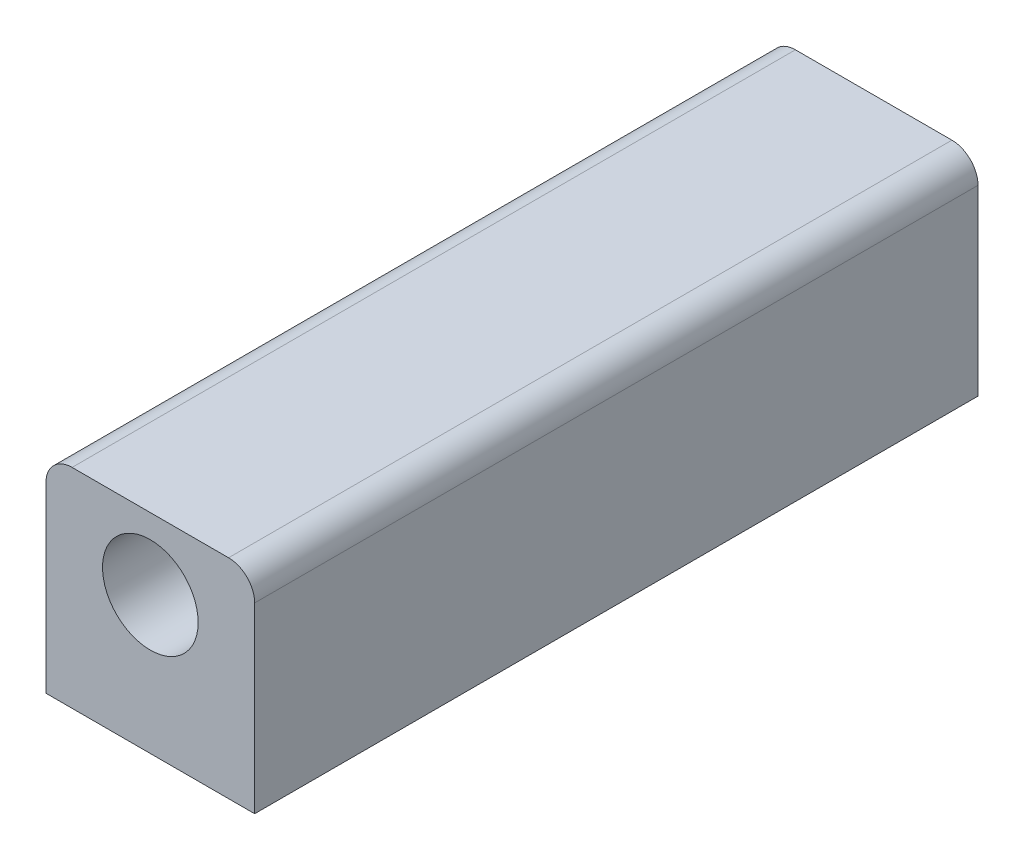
from build123d import *

# Parameters (mm, degrees)
SKETCH1_R           = 5.5
BOSS_EXTRUDE2_DEPTH = 83.2


with BuildPart() as part:
    # Sketch1 → Boss-Extrude2 (new body)
    with BuildSketch(Plane.XY):
        with BuildLine():
            Line((-9, 8.2), (9, 8.2))
            ThreePointArc((9, 8.2), (11.121320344, 7.321320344), (12, 5.2))
            Line((12, 5.2), (12, -15.8))
            Line((12, -15.8), (-12, -15.8))
            Line((-12, -15.8), (-12, 5.2))
            ThreePointArc((-12, 5.2), (-11.121320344, 7.321320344), (-9, 8.2))
        make_face()
        Circle(SKETCH1_R, mode=Mode.SUBTRACT)
    extrude(amount=BOSS_EXTRUDE2_DEPTH)


solid = part.part
